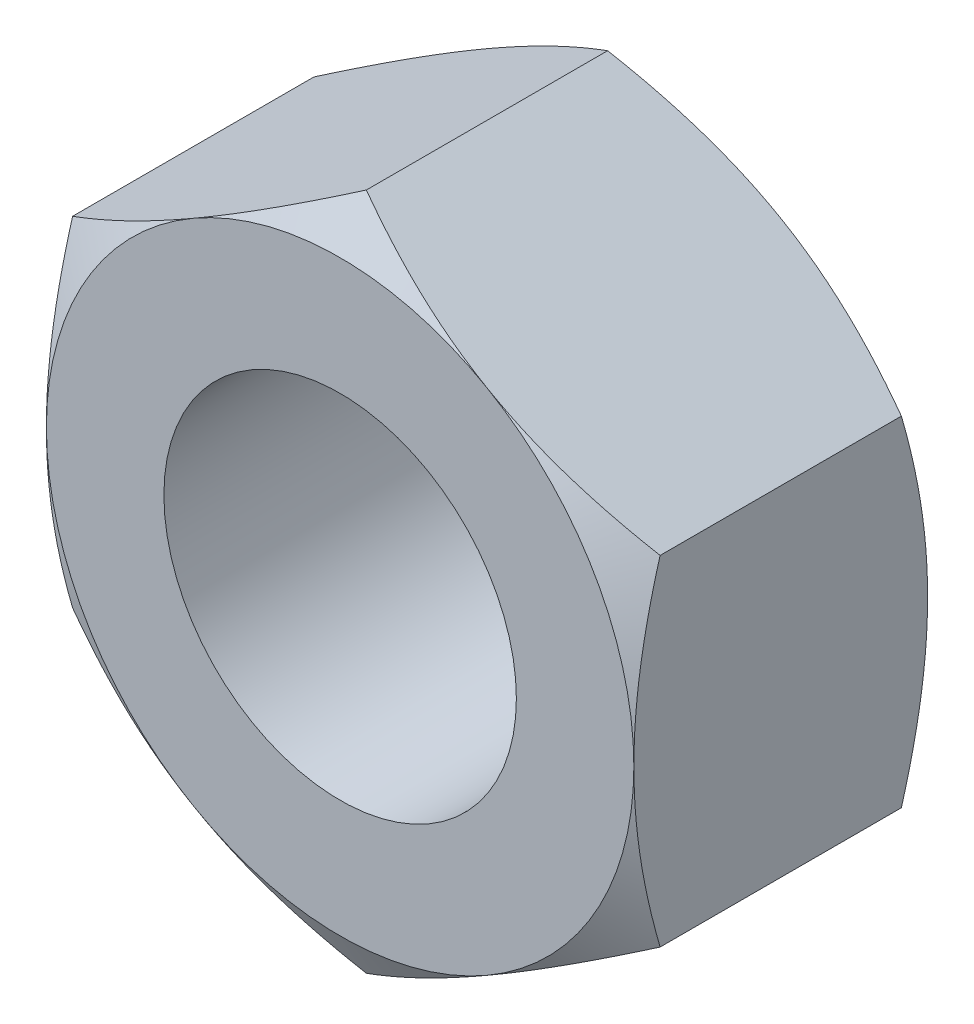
ISO-10303-21;
HEADER;
FILE_DESCRIPTION(('STEP AP214'),'2;1');
FILE_NAME('part.step','',(''),(''),'','','');
FILE_SCHEMA(('AUTOMOTIVE_DESIGN { 1 0 10303 214 1 1 1 1 }'));
ENDSEC;
DATA;
#1=APPLICATION_CONTEXT('core data for automotive mechanical design processes');
#2=APPLICATION_PROTOCOL_DEFINITION('international standard','automotive_design',2000,#1);
#3=PRODUCT_CONTEXT('',#1,'mechanical');
#4=PRODUCT('Part','Part','',(#3));
#5=PRODUCT_RELATED_PRODUCT_CATEGORY('part','',(#4));
#6=PRODUCT_DEFINITION_FORMATION('','',#4);
#7=PRODUCT_DEFINITION_CONTEXT('part definition',#1,'design');
#8=PRODUCT_DEFINITION('design','',#6,#7);
#9=PRODUCT_DEFINITION_SHAPE('','',#8);
#10=(LENGTH_UNIT() NAMED_UNIT(*) SI_UNIT(.MILLI.,.METRE.));
#11=(NAMED_UNIT(*) PLANE_ANGLE_UNIT() SI_UNIT($,.RADIAN.));
#12=(NAMED_UNIT(*) SI_UNIT($,.STERADIAN.) SOLID_ANGLE_UNIT());
#13=UNCERTAINTY_MEASURE_WITH_UNIT(LENGTH_MEASURE(1.E-05),#10,'distance_accuracy_value','');
#14=(GEOMETRIC_REPRESENTATION_CONTEXT(3) GLOBAL_UNCERTAINTY_ASSIGNED_CONTEXT((#13)) GLOBAL_UNIT_ASSIGNED_CONTEXT((#10,
#11,#12)) REPRESENTATION_CONTEXT('',''));
#15=CARTESIAN_POINT('',(0.,0.,0.));
#16=DIRECTION('',(0.,0.,1.));
#17=DIRECTION('',(1.,0.,0.));
#18=AXIS2_PLACEMENT_3D('',#15,#16,#17);
#19=CARTESIAN_POINT('',(-5.,8.66025403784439,0.));
#20=DIRECTION('',(0.,0.,-1.));
#21=DIRECTION('',(-1.,0.,0.));
#22=AXIS2_PLACEMENT_3D('',#19,#20,#21);
#23=PLANE('',#22);
#24=CARTESIAN_POINT('',(0.,0.,0.));
#25=DIRECTION('',(0.,0.,1.));
#26=DIRECTION('',(1.,0.,0.));
#27=AXIS2_PLACEMENT_3D('',#24,#25,#26);
#28=CIRCLE('',#27,3.);
#29=CARTESIAN_POINT('',(3.,0.,0.));
#30=VERTEX_POINT('',#29);
#31=EDGE_CURVE('E318',#30,#30,#28,.T.);
#32=ORIENTED_EDGE('',*,*,#31,.F.);
#33=EDGE_LOOP('',(#32));
#34=FACE_BOUND('',#33,.T.);
#35=CARTESIAN_POINT('',(0.,0.,0.));
#36=DIRECTION('',(0.,0.,-1.));
#37=DIRECTION('',(-1.,0.,0.));
#38=AXIS2_PLACEMENT_3D('',#35,#36,#37);
#39=CIRCLE('',#38,5.);
#40=CARTESIAN_POINT('',(-5.,0.,0.));
#41=VERTEX_POINT('',#40);
#42=CARTESIAN_POINT('',(-2.5,4.3301270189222,0.));
#43=VERTEX_POINT('',#42);
#44=EDGE_CURVE('E326',#41,#43,#39,.T.);
#45=ORIENTED_EDGE('',*,*,#44,.F.);
#46=CARTESIAN_POINT('',(0.,0.,0.));
#47=DIRECTION('',(0.,0.,-1.));
#48=DIRECTION('',(-1.,0.,0.));
#49=AXIS2_PLACEMENT_3D('',#46,#47,#48);
#50=CIRCLE('',#49,5.);
#51=CARTESIAN_POINT('',(-2.5,-4.3301270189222,0.));
#52=VERTEX_POINT('',#51);
#53=EDGE_CURVE('E148',#41,#52,#50,.F.);
#54=ORIENTED_EDGE('',*,*,#53,.T.);
#55=CARTESIAN_POINT('',(2.5,-4.3301270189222,0.));
#56=VERTEX_POINT('',#55);
#57=EDGE_CURVE('E250',#52,#56,#50,.F.);
#58=ORIENTED_EDGE('',*,*,#57,.T.);
#59=CARTESIAN_POINT('',(5.,0.,0.));
#60=VERTEX_POINT('',#59);
#61=EDGE_CURVE('E151',#56,#60,#50,.F.);
#62=ORIENTED_EDGE('',*,*,#61,.T.);
#63=CARTESIAN_POINT('',(2.5,4.3301270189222,0.));
#64=VERTEX_POINT('',#63);
#65=EDGE_CURVE('E126',#60,#64,#50,.F.);
#66=ORIENTED_EDGE('',*,*,#65,.T.);
#67=EDGE_CURVE('E139',#64,#43,#50,.F.);
#68=ORIENTED_EDGE('',*,*,#67,.T.);
#69=EDGE_LOOP('',(#45,#54,#58,#62,#66,#68));
#70=FACE_BOUND('',#69,.T.);
#71=ADVANCED_FACE('F31',(#34,#70),#23,.F.);
#72=CARTESIAN_POINT('',(0.,0.,0.));
#73=DIRECTION('',(0.,0.,-1.));
#74=DIRECTION('',(-1.,0.,0.));
#75=AXIS2_PLACEMENT_3D('',#72,#73,#74);
#76=CONICAL_SURFACE('',#75,5.,1.0471975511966);
#77=CARTESIAN_POINT('',(-5.,-7.76808841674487,-2.44689023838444));
#78=CARTESIAN_POINT('',(-5.,-7.54955729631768,-2.3408271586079));
#79=CARTESIAN_POINT('',(-5.,-7.33052594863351,-2.2357771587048));
#80=CARTESIAN_POINT('',(-5.,-6.89119677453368,-2.02827292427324));
#81=CARTESIAN_POINT('',(-5.,-6.67089875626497,-1.92581909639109));
#82=CARTESIAN_POINT('',(-5.,-6.22764221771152,-1.72356452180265));
#83=CARTESIAN_POINT('',(-5.,-6.00467575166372,-1.62378112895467));
#84=CARTESIAN_POINT('',(-5.,-5.55697391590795,-1.42828024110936));
#85=CARTESIAN_POINT('',(-5.,-5.33223863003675,-1.3325625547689));
#86=CARTESIAN_POINT('',(-5.,-4.87339891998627,-1.14327838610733));
#87=CARTESIAN_POINT('',(-5.,-4.63922509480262,-1.04987922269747));
#88=CARTESIAN_POINT('',(-5.,-4.16814307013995,-0.870116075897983));
#89=CARTESIAN_POINT('',(-5.,-3.93123456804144,-0.783752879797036));
#90=CARTESIAN_POINT('',(-5.,-3.4547449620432,-0.620318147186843));
#91=CARTESIAN_POINT('',(-5.,-3.21517032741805,-0.543227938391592));
#92=CARTESIAN_POINT('',(-5.,-2.73258478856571,-0.400803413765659));
#93=CARTESIAN_POINT('',(-5.,-2.48957498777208,-0.335465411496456));
#94=CARTESIAN_POINT('',(-5.,-2.00129923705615,-0.220011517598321));
#95=CARTESIAN_POINT('',(-5.,-1.75605280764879,-0.169814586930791));
#96=CARTESIAN_POINT('',(-5.,-1.26249605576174,-0.0874824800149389));
#97=CARTESIAN_POINT('',(-5.,-1.0141860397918,-0.0553455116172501));
#98=CARTESIAN_POINT('',(-5.,-0.518993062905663,-0.012117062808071));
#99=CARTESIAN_POINT('',(-5.,-0.272134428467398,-0.000753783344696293));
#100=CARTESIAN_POINT('',(-5.,0.221667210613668,0.000680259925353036));
#101=CARTESIAN_POINT('',(-5.,0.46861021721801,-0.00924951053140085));
#102=CARTESIAN_POINT('',(-5.,0.88737495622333,-0.0434398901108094));
#103=CARTESIAN_POINT('',(-5.,1.05964345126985,-0.0625453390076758));
#104=CARTESIAN_POINT('',(-5.,1.40292147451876,-0.109937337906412));
#105=CARTESIAN_POINT('',(-5.,1.57393083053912,-0.138225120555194));
#106=CARTESIAN_POINT('',(-5.,2.0848367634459,-0.235375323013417));
#107=CARTESIAN_POINT('',(-5.,2.4224263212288,-0.316507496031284));
#108=CARTESIAN_POINT('',(-5.,2.92734712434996,-0.457245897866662));
#109=CARTESIAN_POINT('',(-5.,3.09729243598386,-0.508007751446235));
#110=CARTESIAN_POINT('',(-5.,3.4355315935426,-0.614812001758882));
#111=CARTESIAN_POINT('',(-5.,3.60382542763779,-0.670854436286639));
#112=CARTESIAN_POINT('',(-5.,3.93881633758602,-0.787319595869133));
#113=CARTESIAN_POINT('',(-5.,4.10551390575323,-0.847740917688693));
#114=CARTESIAN_POINT('',(-5.,4.43752572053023,-0.972251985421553));
#115=CARTESIAN_POINT('',(-5.,4.60283999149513,-1.03634166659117));
#116=CARTESIAN_POINT('',(-5.,5.0247181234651,-1.20442083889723));
#117=CARTESIAN_POINT('',(-5.,5.28040451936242,-1.31060995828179));
#118=CARTESIAN_POINT('',(-5.,5.78935527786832,-1.52866046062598));
#119=CARTESIAN_POINT('',(-5.,6.04261943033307,-1.64052233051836));
#120=CARTESIAN_POINT('',(-5.,6.54723296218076,-1.8686538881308));
#121=CARTESIAN_POINT('',(-5.,6.79858179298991,-1.98492478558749));
#122=CARTESIAN_POINT('',(-5.,7.2996679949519,-2.22089526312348));
#123=CARTESIAN_POINT('',(-5.,7.54940532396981,-2.34059493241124));
#124=CARTESIAN_POINT('',(-5.,8.04788706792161,-2.5828728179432));
#125=CARTESIAN_POINT('',(-5.,8.29662972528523,-2.70545464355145));
#126=CARTESIAN_POINT('',(-5.,8.79302192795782,-2.95281408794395));
#127=CARTESIAN_POINT('',(-5.,9.04067146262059,-3.07759172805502));
#128=CARTESIAN_POINT('',(-5.,9.78217969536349,-3.45453689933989));
#129=CARTESIAN_POINT('',(-5.,10.2746876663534,-3.70936064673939));
#130=CARTESIAN_POINT('',(-5.,11.2098406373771,-4.19905291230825));
#131=CARTESIAN_POINT('',(-5.,11.6527184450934,-4.43347890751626));
#132=CARTESIAN_POINT('',(-5.,12.5369382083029,-4.90525945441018));
#133=CARTESIAN_POINT('',(-5.,12.9782800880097,-5.14261414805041));
#134=CARTESIAN_POINT('',(-5.,13.8584885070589,-5.61881737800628));
#135=CARTESIAN_POINT('',(-5.,14.2973585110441,-5.85765952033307));
#136=CARTESIAN_POINT('',(-5.,15.1741337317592,-6.33703983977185));
#137=CARTESIAN_POINT('',(-5.,15.6120390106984,-6.57757790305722));
#138=CARTESIAN_POINT('',(-5.,16.0495987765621,-6.81873886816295));
#139=B_SPLINE_CURVE_WITH_KNOTS('',3,(#77,#78,#79,#80,#81,#82,#83,#84,#85,#86,#87,#88,#89,#90,
#91,#92,#93,#94,#95,#96,#97,#98,#99,#100,#101,#102,#103,#104,#105,#106,#107,#108,#109,#110,#111,
#112,#113,#114,#115,#116,#117,#118,#119,#120,#121,#122,#123,#124,#125,#126,#127,#128,#129,#130,
#131,#132,#133,#134,#135,#136,#137,#138),.UNSPECIFIED.,.F.,.F.,(4,2,2,2,2,2,2,2,2,2,2,2,2,2,2,2,
2,2,2,2,2,2,2,2,2,2,2,2,2,2,4),(0.,0.728738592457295,1.4575906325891,2.19038616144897,
2.92314716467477,3.6793977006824,4.43573274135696,5.19051836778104,5.94506681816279,
6.69550197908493,7.44586265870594,8.18633350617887,8.92682293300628,9.446545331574,
9.96633752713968,11.0064764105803,11.5385246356,12.0705766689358,12.6024589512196,
13.1343318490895,13.9648144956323,14.7953685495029,15.6261521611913,16.4569574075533,
17.2888652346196,18.1207811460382,19.7843134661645,21.2875873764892,22.7909344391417,
24.2898874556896,25.7887408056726),.UNSPECIFIED.);
#140=CARTESIAN_POINT('',(-5.,2.88675134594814,-0.446581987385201));
#141=VERTEX_POINT('',#140);
#142=EDGE_CURVE('E156',#141,#41,#139,.F.);
#143=ORIENTED_EDGE('',*,*,#142,.T.);
#144=ORIENTED_EDGE('',*,*,#44,.T.);
#145=CARTESIAN_POINT('',(0.0002,5.7736181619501,-0.446648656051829));
#146=CARTESIAN_POINT('',(-0.219534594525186,5.64675433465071,-0.373386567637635));
#147=CARTESIAN_POINT('',(-0.441148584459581,5.5188054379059,-0.306751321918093));
#148=CARTESIAN_POINT('',(-0.888213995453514,5.26069210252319,-0.190438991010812));
#149=CARTESIAN_POINT('',(-1.11367335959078,5.13052307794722,-0.140803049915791));
#150=CARTESIAN_POINT('',(-1.56183230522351,4.87177839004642,-0.063551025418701));
#151=CARTESIAN_POINT('',(-1.78446209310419,4.74324302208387,-0.035420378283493));
#152=CARTESIAN_POINT('',(-2.11918990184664,4.54998783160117,-0.0101949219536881));
#153=CARTESIAN_POINT('',(-2.23084219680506,4.48552534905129,-0.00461345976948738));
#154=CARTESIAN_POINT('',(-2.4542499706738,4.35654081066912,0.000797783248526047));
#155=CARTESIAN_POINT('',(-2.56600544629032,4.29201875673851,0.000627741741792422));
#156=CARTESIAN_POINT('',(-2.87218423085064,4.11524635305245,-0.00775363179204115));
#157=CARTESIAN_POINT('',(-3.06650608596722,4.00305457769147,-0.0218297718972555));
#158=CARTESIAN_POINT('',(-3.45386010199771,3.77941563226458,-0.0664652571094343));
#159=CARTESIAN_POINT('',(-3.64689090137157,3.66796924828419,-0.0970398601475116));
#160=CARTESIAN_POINT('',(-4.03502534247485,3.44387972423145,-0.173468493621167));
#161=CARTESIAN_POINT('',(-4.23007999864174,3.33126486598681,-0.219646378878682));
#162=CARTESIAN_POINT('',(-4.61728034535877,3.10771464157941,-0.324451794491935));
#163=CARTESIAN_POINT('',(-4.80943099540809,2.99677641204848,-0.383054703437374));
#164=CARTESIAN_POINT('',(-5.0002,2.8866358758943,-0.446648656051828));
#165=B_SPLINE_CURVE_WITH_KNOTS('',3,(#145,#146,#147,#148,#149,#150,#151,#152,#153,#154,#155,
#156,#157,#158,#159,#160,#161,#162,#163,#164),.UNSPECIFIED.,.F.,.F.,(4,2,2,2,2,2,2,2,2,4),(0.,
0.79255584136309,1.58701660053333,2.36181537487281,2.74884076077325,3.13585419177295,
3.80962362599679,4.48401723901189,5.17336882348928,5.86136694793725),.UNSPECIFIED.);
#166=EDGE_CURVE('E188',#43,#141,#165,.T.);
#167=ORIENTED_EDGE('',*,*,#166,.T.);
#168=EDGE_LOOP('',(#143,#144,#167));
#169=FACE_BOUND('',#168,.T.);
#170=ADVANCED_FACE('F175',(#169),#76,.T.);
#171=CARTESIAN_POINT('',(5.0002,2.8866358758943,-0.446648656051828));
#172=CARTESIAN_POINT('',(4.78046540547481,3.01349970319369,-0.373386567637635));
#173=CARTESIAN_POINT('',(4.55885141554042,3.1414485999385,-0.306751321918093));
#174=CARTESIAN_POINT('',(4.11178600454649,3.39956193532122,-0.190438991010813));
#175=CARTESIAN_POINT('',(3.88632664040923,3.52973095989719,-0.140803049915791));
#176=CARTESIAN_POINT('',(3.43816769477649,3.78847564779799,-0.0635510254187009));
#177=CARTESIAN_POINT('',(3.21553790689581,3.91701101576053,-0.0354203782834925));
#178=CARTESIAN_POINT('',(2.88081009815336,4.11026620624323,-0.0101949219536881));
#179=CARTESIAN_POINT('',(2.76915780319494,4.17472868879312,-0.00461345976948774));
#180=CARTESIAN_POINT('',(2.5457500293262,4.30371322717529,0.000797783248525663));
#181=CARTESIAN_POINT('',(2.43399455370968,4.3682352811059,0.000627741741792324));
#182=CARTESIAN_POINT('',(2.12781576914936,4.54500768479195,-0.00775363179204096));
#183=CARTESIAN_POINT('',(1.93349391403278,4.65719946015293,-0.0218297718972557));
#184=CARTESIAN_POINT('',(1.54613989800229,4.88083840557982,-0.0664652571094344));
#185=CARTESIAN_POINT('',(1.35310909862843,4.99228478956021,-0.0970398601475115));
#186=CARTESIAN_POINT('',(0.964974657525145,5.21637431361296,-0.173468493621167));
#187=CARTESIAN_POINT('',(0.769920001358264,5.32898917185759,-0.219646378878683));
#188=CARTESIAN_POINT('',(0.382719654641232,5.55253939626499,-0.324451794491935));
#189=CARTESIAN_POINT('',(0.190569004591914,5.66347762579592,-0.383054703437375));
#190=CARTESIAN_POINT('',(-0.000199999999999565,5.7736181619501,-0.446648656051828));
#191=B_SPLINE_CURVE_WITH_KNOTS('',3,(#171,#172,#173,#174,#175,#176,#177,#178,#179,#180,#181,
#182,#183,#184,#185,#186,#187,#188,#189,#190),.UNSPECIFIED.,.F.,.F.,(4,2,2,2,2,2,2,2,2,4),(0.,
0.79255584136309,1.58701660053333,2.3618153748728,2.74884076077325,3.13585419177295,
3.80962362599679,4.48401723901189,5.17336882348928,5.86136694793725),.UNSPECIFIED.);
#192=CARTESIAN_POINT('',(0.,5.77350269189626,-0.446581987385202));
#193=VERTEX_POINT('',#192);
#194=EDGE_CURVE('E135',#64,#193,#191,.T.);
#195=ORIENTED_EDGE('',*,*,#194,.T.);
#196=EDGE_CURVE('E142',#193,#43,#165,.T.);
#197=ORIENTED_EDGE('',*,*,#196,.T.);
#198=ORIENTED_EDGE('',*,*,#67,.F.);
#199=EDGE_LOOP('',(#195,#197,#198));
#200=FACE_BOUND('',#199,.T.);
#201=ADVANCED_FACE('F140',(#200),#76,.T.);
#202=CARTESIAN_POINT('',(5.,-7.76808841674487,-2.44689023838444));
#203=CARTESIAN_POINT('',(5.,-7.54955729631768,-2.3408271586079));
#204=CARTESIAN_POINT('',(5.,-7.33052594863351,-2.2357771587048));
#205=CARTESIAN_POINT('',(5.,-6.89119677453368,-2.02827292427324));
#206=CARTESIAN_POINT('',(5.,-6.67089875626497,-1.92581909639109));
#207=CARTESIAN_POINT('',(5.,-6.22764221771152,-1.72356452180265));
#208=CARTESIAN_POINT('',(5.,-6.00467575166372,-1.62378112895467));
#209=CARTESIAN_POINT('',(5.,-5.55697391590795,-1.42828024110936));
#210=CARTESIAN_POINT('',(5.,-5.33223863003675,-1.3325625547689));
#211=CARTESIAN_POINT('',(5.,-4.87339891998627,-1.14327838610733));
#212=CARTESIAN_POINT('',(5.,-4.63922509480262,-1.04987922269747));
#213=CARTESIAN_POINT('',(5.,-4.16814307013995,-0.870116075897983));
#214=CARTESIAN_POINT('',(5.,-3.93123456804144,-0.783752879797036));
#215=CARTESIAN_POINT('',(5.,-3.4547449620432,-0.620318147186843));
#216=CARTESIAN_POINT('',(5.,-3.21517032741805,-0.543227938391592));
#217=CARTESIAN_POINT('',(5.,-2.73258478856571,-0.400803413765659));
#218=CARTESIAN_POINT('',(5.,-2.48957498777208,-0.335465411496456));
#219=CARTESIAN_POINT('',(5.,-2.00129923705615,-0.220011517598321));
#220=CARTESIAN_POINT('',(5.,-1.75605280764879,-0.169814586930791));
#221=CARTESIAN_POINT('',(5.,-1.26249605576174,-0.0874824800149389));
#222=CARTESIAN_POINT('',(5.,-1.0141860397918,-0.0553455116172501));
#223=CARTESIAN_POINT('',(5.,-0.518993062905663,-0.012117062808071));
#224=CARTESIAN_POINT('',(5.,-0.272134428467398,-0.000753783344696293));
#225=CARTESIAN_POINT('',(5.,0.221667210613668,0.000680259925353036));
#226=CARTESIAN_POINT('',(5.,0.46861021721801,-0.00924951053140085));
#227=CARTESIAN_POINT('',(5.,0.88737495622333,-0.0434398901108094));
#228=CARTESIAN_POINT('',(5.,1.05964345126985,-0.0625453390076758));
#229=CARTESIAN_POINT('',(5.,1.40292147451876,-0.109937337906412));
#230=CARTESIAN_POINT('',(5.,1.57393083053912,-0.138225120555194));
#231=CARTESIAN_POINT('',(5.,2.0848367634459,-0.235375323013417));
#232=CARTESIAN_POINT('',(5.,2.4224263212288,-0.316507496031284));
#233=CARTESIAN_POINT('',(5.,2.92734712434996,-0.457245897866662));
#234=CARTESIAN_POINT('',(5.,3.09729243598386,-0.508007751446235));
#235=CARTESIAN_POINT('',(5.,3.4355315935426,-0.614812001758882));
#236=CARTESIAN_POINT('',(5.,3.60382542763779,-0.670854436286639));
#237=CARTESIAN_POINT('',(5.,3.93881633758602,-0.787319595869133));
#238=CARTESIAN_POINT('',(5.,4.10551390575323,-0.847740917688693));
#239=CARTESIAN_POINT('',(5.,4.43752572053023,-0.972251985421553));
#240=CARTESIAN_POINT('',(5.,4.60283999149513,-1.03634166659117));
#241=CARTESIAN_POINT('',(5.,5.0247181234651,-1.20442083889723));
#242=CARTESIAN_POINT('',(5.,5.28040451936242,-1.31060995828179));
#243=CARTESIAN_POINT('',(5.,5.78935527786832,-1.52866046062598));
#244=CARTESIAN_POINT('',(5.,6.04261943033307,-1.64052233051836));
#245=CARTESIAN_POINT('',(5.,6.54723296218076,-1.8686538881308));
#246=CARTESIAN_POINT('',(5.,6.79858179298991,-1.98492478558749));
#247=CARTESIAN_POINT('',(5.,7.2996679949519,-2.22089526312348));
#248=CARTESIAN_POINT('',(5.,7.54940532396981,-2.34059493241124));
#249=CARTESIAN_POINT('',(5.,8.04788706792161,-2.5828728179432));
#250=CARTESIAN_POINT('',(5.,8.29662972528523,-2.70545464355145));
#251=CARTESIAN_POINT('',(5.,8.79302192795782,-2.95281408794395));
#252=CARTESIAN_POINT('',(5.,9.04067146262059,-3.07759172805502));
#253=CARTESIAN_POINT('',(5.,9.78217969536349,-3.45453689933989));
#254=CARTESIAN_POINT('',(5.,10.2746876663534,-3.70936064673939));
#255=CARTESIAN_POINT('',(5.,11.2098406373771,-4.19905291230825));
#256=CARTESIAN_POINT('',(5.,11.6527184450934,-4.43347890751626));
#257=CARTESIAN_POINT('',(5.,12.5369382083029,-4.90525945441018));
#258=CARTESIAN_POINT('',(5.,12.9782800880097,-5.14261414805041));
#259=CARTESIAN_POINT('',(5.,13.8584885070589,-5.61881737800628));
#260=CARTESIAN_POINT('',(5.,14.2973585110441,-5.85765952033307));
#261=CARTESIAN_POINT('',(5.,15.1741337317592,-6.33703983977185));
#262=CARTESIAN_POINT('',(5.,15.6120390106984,-6.57757790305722));
#263=CARTESIAN_POINT('',(5.,16.0495987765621,-6.81873886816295));
#264=B_SPLINE_CURVE_WITH_KNOTS('',3,(#202,#203,#204,#205,#206,#207,#208,#209,#210,#211,#212,
#213,#214,#215,#216,#217,#218,#219,#220,#221,#222,#223,#224,#225,#226,#227,#228,#229,#230,#231,
#232,#233,#234,#235,#236,#237,#238,#239,#240,#241,#242,#243,#244,#245,#246,#247,#248,#249,#250,
#251,#252,#253,#254,#255,#256,#257,#258,#259,#260,#261,#262,#263),.UNSPECIFIED.,.F.,.F.,(4,2,2,
2,2,2,2,2,2,2,2,2,2,2,2,2,2,2,2,2,2,2,2,2,2,2,2,2,2,2,4),(0.,0.728738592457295,1.4575906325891,
2.19038616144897,2.92314716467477,3.6793977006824,4.43573274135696,5.19051836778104,
5.94506681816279,6.69550197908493,7.44586265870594,8.18633350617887,8.92682293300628,
9.446545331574,9.96633752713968,11.0064764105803,11.5385246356,12.0705766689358,
12.6024589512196,13.1343318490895,13.9648144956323,14.7953685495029,15.6261521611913,
16.4569574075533,17.2888652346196,18.1207811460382,19.7843134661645,21.2875873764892,
22.7909344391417,24.2898874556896,25.7887408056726),.UNSPECIFIED.);
#265=CARTESIAN_POINT('',(5.,2.88675134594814,-0.446581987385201));
#266=VERTEX_POINT('',#265);
#267=EDGE_CURVE('E129',#60,#266,#264,.T.);
#268=ORIENTED_EDGE('',*,*,#267,.T.);
#269=EDGE_CURVE('E122',#266,#64,#191,.T.);
#270=ORIENTED_EDGE('',*,*,#269,.T.);
#271=ORIENTED_EDGE('',*,*,#65,.F.);
#272=EDGE_LOOP('',(#268,#270,#271));
#273=FACE_BOUND('',#272,.T.);
#274=ADVANCED_FACE('F124',(#273),#76,.T.);
#275=CARTESIAN_POINT('',(-0.0002,-5.7736181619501,-0.446648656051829));
#276=CARTESIAN_POINT('',(0.219534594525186,-5.64675433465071,-0.373386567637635));
#277=CARTESIAN_POINT('',(0.441148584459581,-5.5188054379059,-0.306751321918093));
#278=CARTESIAN_POINT('',(0.888213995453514,-5.26069210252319,-0.190438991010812));
#279=CARTESIAN_POINT('',(1.11367335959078,-5.13052307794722,-0.140803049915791));
#280=CARTESIAN_POINT('',(1.56183230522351,-4.87177839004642,-0.063551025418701));
#281=CARTESIAN_POINT('',(1.78446209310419,-4.74324302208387,-0.035420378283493));
#282=CARTESIAN_POINT('',(2.11918990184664,-4.54998783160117,-0.0101949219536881));
#283=CARTESIAN_POINT('',(2.23084219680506,-4.48552534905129,-0.00461345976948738));
#284=CARTESIAN_POINT('',(2.4542499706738,-4.35654081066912,0.000797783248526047));
#285=CARTESIAN_POINT('',(2.56600544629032,-4.29201875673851,0.000627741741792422));
#286=CARTESIAN_POINT('',(2.87218423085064,-4.11524635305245,-0.00775363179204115));
#287=CARTESIAN_POINT('',(3.06650608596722,-4.00305457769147,-0.0218297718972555));
#288=CARTESIAN_POINT('',(3.45386010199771,-3.77941563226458,-0.0664652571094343));
#289=CARTESIAN_POINT('',(3.64689090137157,-3.66796924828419,-0.0970398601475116));
#290=CARTESIAN_POINT('',(4.03502534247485,-3.44387972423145,-0.173468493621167));
#291=CARTESIAN_POINT('',(4.23007999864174,-3.33126486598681,-0.219646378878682));
#292=CARTESIAN_POINT('',(4.61728034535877,-3.10771464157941,-0.324451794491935));
#293=CARTESIAN_POINT('',(4.80943099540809,-2.99677641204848,-0.383054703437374));
#294=CARTESIAN_POINT('',(5.0002,-2.8866358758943,-0.446648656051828));
#295=B_SPLINE_CURVE_WITH_KNOTS('',3,(#275,#276,#277,#278,#279,#280,#281,#282,#283,#284,#285,
#286,#287,#288,#289,#290,#291,#292,#293,#294),.UNSPECIFIED.,.F.,.F.,(4,2,2,2,2,2,2,2,2,4),(0.,
0.79255584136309,1.58701660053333,2.36181537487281,2.74884076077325,3.13585419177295,
3.80962362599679,4.48401723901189,5.17336882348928,5.86136694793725),.UNSPECIFIED.);
#296=CARTESIAN_POINT('',(5.,-2.88675134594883,-0.446581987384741));
#297=VERTEX_POINT('',#296);
#298=EDGE_CURVE('E202',#56,#297,#295,.T.);
#299=ORIENTED_EDGE('',*,*,#298,.T.);
#300=EDGE_CURVE('E201',#297,#60,#264,.T.);
#301=ORIENTED_EDGE('',*,*,#300,.T.);
#302=ORIENTED_EDGE('',*,*,#61,.F.);
#303=EDGE_LOOP('',(#299,#301,#302));
#304=FACE_BOUND('',#303,.T.);
#305=ADVANCED_FACE('F426',(#304),#76,.T.);
#306=CARTESIAN_POINT('',(0.,-5.77350269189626,-0.446581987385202));
#307=VERTEX_POINT('',#306);
#308=EDGE_CURVE('E260',#307,#56,#295,.T.);
#309=ORIENTED_EDGE('',*,*,#308,.T.);
#310=ORIENTED_EDGE('',*,*,#57,.F.);
#311=CARTESIAN_POINT('',(-5.0002,-2.8866358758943,-0.446648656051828));
#312=CARTESIAN_POINT('',(-4.78046540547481,-3.01349970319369,-0.373386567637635));
#313=CARTESIAN_POINT('',(-4.55885141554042,-3.1414485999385,-0.306751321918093));
#314=CARTESIAN_POINT('',(-4.11178600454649,-3.39956193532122,-0.190438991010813));
#315=CARTESIAN_POINT('',(-3.88632664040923,-3.52973095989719,-0.140803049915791));
#316=CARTESIAN_POINT('',(-3.43816769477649,-3.78847564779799,-0.0635510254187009));
#317=CARTESIAN_POINT('',(-3.21553790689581,-3.91701101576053,-0.0354203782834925));
#318=CARTESIAN_POINT('',(-2.88081009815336,-4.11026620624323,-0.0101949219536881));
#319=CARTESIAN_POINT('',(-2.76915780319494,-4.17472868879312,-0.00461345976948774));
#320=CARTESIAN_POINT('',(-2.5457500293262,-4.30371322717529,0.000797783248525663));
#321=CARTESIAN_POINT('',(-2.43399455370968,-4.3682352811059,0.000627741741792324));
#322=CARTESIAN_POINT('',(-2.12781576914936,-4.54500768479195,-0.00775363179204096));
#323=CARTESIAN_POINT('',(-1.93349391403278,-4.65719946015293,-0.0218297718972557));
#324=CARTESIAN_POINT('',(-1.54613989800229,-4.88083840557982,-0.0664652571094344));
#325=CARTESIAN_POINT('',(-1.35310909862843,-4.99228478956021,-0.0970398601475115));
#326=CARTESIAN_POINT('',(-0.964974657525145,-5.21637431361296,-0.173468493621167));
#327=CARTESIAN_POINT('',(-0.769920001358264,-5.32898917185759,-0.219646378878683));
#328=CARTESIAN_POINT('',(-0.382719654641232,-5.55253939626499,-0.324451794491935));
#329=CARTESIAN_POINT('',(-0.190569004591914,-5.66347762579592,-0.383054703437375));
#330=CARTESIAN_POINT('',(0.000199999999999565,-5.7736181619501,-0.446648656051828));
#331=B_SPLINE_CURVE_WITH_KNOTS('',3,(#311,#312,#313,#314,#315,#316,#317,#318,#319,#320,#321,
#322,#323,#324,#325,#326,#327,#328,#329,#330),.UNSPECIFIED.,.F.,.F.,(4,2,2,2,2,2,2,2,2,4),(0.,
0.79255584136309,1.58701660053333,2.3618153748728,2.74884076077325,3.13585419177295,
3.80962362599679,4.48401723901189,5.17336882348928,5.86136694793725),.UNSPECIFIED.);
#332=EDGE_CURVE('E264',#52,#307,#331,.T.);
#333=ORIENTED_EDGE('',*,*,#332,.T.);
#334=EDGE_LOOP('',(#309,#310,#333));
#335=FACE_BOUND('',#334,.T.);
#336=ADVANCED_FACE('F181',(#335),#76,.T.);
#337=CARTESIAN_POINT('',(-5.,-2.88675134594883,-0.446581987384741));
#338=VERTEX_POINT('',#337);
#339=EDGE_CURVE('E169',#338,#52,#331,.T.);
#340=ORIENTED_EDGE('',*,*,#339,.T.);
#341=ORIENTED_EDGE('',*,*,#53,.F.);
#342=EDGE_CURVE('E134',#41,#338,#139,.F.);
#343=ORIENTED_EDGE('',*,*,#342,.T.);
#344=EDGE_LOOP('',(#340,#341,#343));
#345=FACE_BOUND('',#344,.T.);
#346=ADVANCED_FACE('F269',(#345),#76,.T.);
#347=CARTESIAN_POINT('',(5.,2.88675134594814,-5.));
#348=DIRECTION('',(0.5,0.866025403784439,0.));
#349=DIRECTION('',(-0.866025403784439,0.5,0.));
#350=AXIS2_PLACEMENT_3D('',#347,#348,#349);
#351=PLANE('',#350);
#352=CARTESIAN_POINT('',(-0.0002,5.7736181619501,-4.55335134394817));
#353=CARTESIAN_POINT('',(0.219534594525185,5.64675433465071,-4.62661343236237));
#354=CARTESIAN_POINT('',(0.441148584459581,5.5188054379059,-4.69324867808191));
#355=CARTESIAN_POINT('',(0.888213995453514,5.26069210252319,-4.80956100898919));
#356=CARTESIAN_POINT('',(1.11367335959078,5.13052307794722,-4.85919695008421));
#357=CARTESIAN_POINT('',(1.56183230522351,4.87177839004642,-4.9364489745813));
#358=CARTESIAN_POINT('',(1.78446209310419,4.74324302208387,-4.96457962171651));
#359=CARTESIAN_POINT('',(2.11918990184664,4.54998783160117,-4.98980507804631));
#360=CARTESIAN_POINT('',(2.23084219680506,4.48552534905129,-4.99538654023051));
#361=CARTESIAN_POINT('',(2.4542499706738,4.35654081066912,-5.00079778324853));
#362=CARTESIAN_POINT('',(2.56600544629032,4.29201875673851,-5.00062774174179));
#363=CARTESIAN_POINT('',(2.87218423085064,4.11524635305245,-4.99224636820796));
#364=CARTESIAN_POINT('',(3.06650608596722,4.00305457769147,-4.97817022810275));
#365=CARTESIAN_POINT('',(3.45386010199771,3.77941563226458,-4.93353474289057));
#366=CARTESIAN_POINT('',(3.64689090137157,3.66796924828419,-4.90296013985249));
#367=CARTESIAN_POINT('',(4.03502534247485,3.44387972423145,-4.82653150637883));
#368=CARTESIAN_POINT('',(4.23007999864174,3.33126486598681,-4.78035362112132));
#369=CARTESIAN_POINT('',(4.61728034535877,3.10771464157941,-4.67554820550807));
#370=CARTESIAN_POINT('',(4.80943099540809,2.99677641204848,-4.61694529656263));
#371=CARTESIAN_POINT('',(5.0002,2.8866358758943,-4.55335134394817));
#372=B_SPLINE_CURVE_WITH_KNOTS('',3,(#352,#353,#354,#355,#356,#357,#358,#359,#360,#361,#362,
#363,#364,#365,#366,#367,#368,#369,#370,#371),.UNSPECIFIED.,.F.,.F.,(4,2,2,2,2,2,2,2,2,4),(0.,
0.79255584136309,1.58701660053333,2.36181537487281,2.74884076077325,3.13585419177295,
3.80962362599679,4.48401723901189,5.17336882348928,5.86136694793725),.UNSPECIFIED.);
#373=CARTESIAN_POINT('',(0.,5.77350269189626,-4.5534180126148));
#374=VERTEX_POINT('',#373);
#375=CARTESIAN_POINT('',(2.5,4.3301270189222,-5.));
#376=VERTEX_POINT('',#375);
#377=EDGE_CURVE('E235',#374,#376,#372,.T.);
#378=ORIENTED_EDGE('',*,*,#377,.F.);
#379=DIRECTION('',(0.,0.,1.));
#380=VECTOR('',#379,1.);
#381=CARTESIAN_POINT('',(0.,5.77350269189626,-5.));
#382=LINE('',#381,#380);
#383=EDGE_CURVE('E155',#374,#193,#382,.T.);
#384=ORIENTED_EDGE('',*,*,#383,.T.);
#385=ORIENTED_EDGE('',*,*,#194,.F.);
#386=ORIENTED_EDGE('',*,*,#269,.F.);
#387=DIRECTION('',(0.,0.,1.));
#388=VECTOR('',#387,1.);
#389=CARTESIAN_POINT('',(5.,2.88675134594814,-5.));
#390=LINE('',#389,#388);
#391=CARTESIAN_POINT('',(5.,2.88675134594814,-4.5534180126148));
#392=VERTEX_POINT('',#391);
#393=EDGE_CURVE('E147',#392,#266,#390,.T.);
#394=ORIENTED_EDGE('',*,*,#393,.F.);
#395=EDGE_CURVE('E230',#376,#392,#372,.T.);
#396=ORIENTED_EDGE('',*,*,#395,.F.);
#397=EDGE_LOOP('',(#378,#384,#385,#386,#394,#396));
#398=FACE_BOUND('',#397,.T.);
#399=ADVANCED_FACE('F33',(#398),#351,.T.);
#400=CARTESIAN_POINT('',(5.,-2.88675134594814,-5.));
#401=DIRECTION('',(1.,0.,0.));
#402=DIRECTION('',(0.,0.,-1.));
#403=AXIS2_PLACEMENT_3D('',#400,#401,#402);
#404=PLANE('',#403);
#405=CARTESIAN_POINT('',(5.,-7.76808841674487,-2.55310976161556));
#406=CARTESIAN_POINT('',(5.,-7.54955729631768,-2.6591728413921));
#407=CARTESIAN_POINT('',(5.,-7.33052594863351,-2.7642228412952));
#408=CARTESIAN_POINT('',(5.,-6.89119677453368,-2.97172707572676));
#409=CARTESIAN_POINT('',(5.,-6.67089875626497,-3.07418090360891));
#410=CARTESIAN_POINT('',(5.,-6.22764221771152,-3.27643547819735));
#411=CARTESIAN_POINT('',(5.,-6.00467575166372,-3.37621887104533));
#412=CARTESIAN_POINT('',(5.,-5.55697391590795,-3.57171975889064));
#413=CARTESIAN_POINT('',(5.,-5.33223863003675,-3.6674374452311));
#414=CARTESIAN_POINT('',(5.,-4.87339891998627,-3.85672161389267));
#415=CARTESIAN_POINT('',(5.,-4.63922509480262,-3.95012077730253));
#416=CARTESIAN_POINT('',(5.,-4.16814307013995,-4.12988392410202));
#417=CARTESIAN_POINT('',(5.,-3.93123456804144,-4.21624712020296));
#418=CARTESIAN_POINT('',(5.,-3.4547449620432,-4.37968185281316));
#419=CARTESIAN_POINT('',(5.,-3.21517032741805,-4.45677206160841));
#420=CARTESIAN_POINT('',(5.,-2.73258478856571,-4.59919658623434));
#421=CARTESIAN_POINT('',(5.,-2.48957498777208,-4.66453458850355));
#422=CARTESIAN_POINT('',(5.,-2.00129923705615,-4.77998848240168));
#423=CARTESIAN_POINT('',(5.,-1.75605280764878,-4.83018541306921));
#424=CARTESIAN_POINT('',(5.,-1.26249605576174,-4.91251751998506));
#425=CARTESIAN_POINT('',(5.,-1.0141860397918,-4.94465448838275));
#426=CARTESIAN_POINT('',(5.,-0.518993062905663,-4.98788293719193));
#427=CARTESIAN_POINT('',(5.,-0.272134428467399,-4.9992462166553));
#428=CARTESIAN_POINT('',(5.,0.221667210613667,-5.00068025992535));
#429=CARTESIAN_POINT('',(5.,0.468610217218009,-4.9907504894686));
#430=CARTESIAN_POINT('',(5.,0.88737495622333,-4.95656010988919));
#431=CARTESIAN_POINT('',(5.,1.05964345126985,-4.93745466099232));
#432=CARTESIAN_POINT('',(5.,1.40292147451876,-4.89006266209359));
#433=CARTESIAN_POINT('',(5.,1.57393083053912,-4.86177487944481));
#434=CARTESIAN_POINT('',(5.,2.0848367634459,-4.76462467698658));
#435=CARTESIAN_POINT('',(5.,2.4224263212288,-4.68349250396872));
#436=CARTESIAN_POINT('',(5.,2.92734712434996,-4.54275410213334));
#437=CARTESIAN_POINT('',(5.,3.09729243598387,-4.49199224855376));
#438=CARTESIAN_POINT('',(5.,3.4355315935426,-4.38518799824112));
#439=CARTESIAN_POINT('',(5.,3.60382542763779,-4.32914556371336));
#440=CARTESIAN_POINT('',(5.,3.93881633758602,-4.21268040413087));
#441=CARTESIAN_POINT('',(5.,4.10551390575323,-4.15225908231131));
#442=CARTESIAN_POINT('',(5.,4.43752572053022,-4.02774801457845));
#443=CARTESIAN_POINT('',(5.,4.60283999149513,-3.96365833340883));
#444=CARTESIAN_POINT('',(5.,5.02471812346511,-3.79557916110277));
#445=CARTESIAN_POINT('',(5.,5.28040451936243,-3.68939004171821));
#446=CARTESIAN_POINT('',(5.,5.78935527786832,-3.47133953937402));
#447=CARTESIAN_POINT('',(5.,6.04261943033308,-3.35947766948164));
#448=CARTESIAN_POINT('',(5.,6.54723296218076,-3.1313461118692));
#449=CARTESIAN_POINT('',(5.,6.79858179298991,-3.01507521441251));
#450=CARTESIAN_POINT('',(5.,7.2996679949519,-2.77910473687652));
#451=CARTESIAN_POINT('',(5.,7.54940532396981,-2.65940506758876));
#452=CARTESIAN_POINT('',(5.,8.04788706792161,-2.4171271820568));
#453=CARTESIAN_POINT('',(5.,8.29662972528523,-2.29454535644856));
#454=CARTESIAN_POINT('',(5.,8.79302192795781,-2.04718591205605));
#455=CARTESIAN_POINT('',(5.,9.04067146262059,-1.92240827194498));
#456=CARTESIAN_POINT('',(5.,9.78217969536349,-1.54546310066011));
#457=CARTESIAN_POINT('',(5.,10.2746876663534,-1.29063935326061));
#458=CARTESIAN_POINT('',(5.,11.2098406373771,-0.800947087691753));
#459=CARTESIAN_POINT('',(5.,11.6527184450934,-0.566521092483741));
#460=CARTESIAN_POINT('',(5.,12.5369382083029,-0.0947405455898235));
#461=CARTESIAN_POINT('',(5.,12.9782800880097,0.142614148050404));
#462=CARTESIAN_POINT('',(5.,13.8584885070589,0.618817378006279));
#463=CARTESIAN_POINT('',(5.,14.2973585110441,0.857659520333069));
#464=CARTESIAN_POINT('',(5.,15.1741337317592,1.33703983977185));
#465=CARTESIAN_POINT('',(5.,15.6120390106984,1.57757790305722));
#466=CARTESIAN_POINT('',(5.,16.0495987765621,1.81873886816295));
#467=B_SPLINE_CURVE_WITH_KNOTS('',3,(#405,#406,#407,#408,#409,#410,#411,#412,#413,#414,#415,
#416,#417,#418,#419,#420,#421,#422,#423,#424,#425,#426,#427,#428,#429,#430,#431,#432,#433,#434,
#435,#436,#437,#438,#439,#440,#441,#442,#443,#444,#445,#446,#447,#448,#449,#450,#451,#452,#453,
#454,#455,#456,#457,#458,#459,#460,#461,#462,#463,#464,#465,#466),.UNSPECIFIED.,.F.,.F.,(4,2,2,
2,2,2,2,2,2,2,2,2,2,2,2,2,2,2,2,2,2,2,2,2,2,2,2,2,2,2,4),(0.,0.728738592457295,1.4575906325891,
2.19038616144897,2.92314716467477,3.67939770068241,4.43573274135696,5.19051836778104,
5.94506681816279,6.69550197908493,7.44586265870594,8.18633350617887,8.92682293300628,
9.446545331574,9.96633752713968,11.0064764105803,11.5385246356,12.0705766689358,
12.6024589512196,13.1343318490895,13.9648144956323,14.7953685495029,15.6261521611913,
16.4569574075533,17.2888652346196,18.1207811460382,19.7843134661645,21.2875873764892,
22.7909344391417,24.2898874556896,25.7887408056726),.UNSPECIFIED.);
#468=CARTESIAN_POINT('',(5.,0.,-5.));
#469=VERTEX_POINT('',#468);
#470=EDGE_CURVE('E224',#392,#469,#467,.F.);
#471=ORIENTED_EDGE('',*,*,#470,.F.);
#472=ORIENTED_EDGE('',*,*,#393,.T.);
#473=ORIENTED_EDGE('',*,*,#267,.F.);
#474=ORIENTED_EDGE('',*,*,#300,.F.);
#475=DIRECTION('',(0.,0.,1.));
#476=VECTOR('',#475,1.);
#477=CARTESIAN_POINT('',(5.,-2.88675134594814,-5.));
#478=LINE('',#477,#476);
#479=CARTESIAN_POINT('',(5.,-2.88675134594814,-4.5534180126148));
#480=VERTEX_POINT('',#479);
#481=EDGE_CURVE('E237',#480,#297,#478,.T.);
#482=ORIENTED_EDGE('',*,*,#481,.F.);
#483=EDGE_CURVE('E218',#469,#480,#467,.F.);
#484=ORIENTED_EDGE('',*,*,#483,.F.);
#485=EDGE_LOOP('',(#471,#472,#473,#474,#482,#484));
#486=FACE_BOUND('',#485,.T.);
#487=ADVANCED_FACE('F208',(#486),#404,.T.);
#488=CARTESIAN_POINT('',(5.,-2.88675134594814,-5.));
#489=DIRECTION('',(0.5,-0.866025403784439,0.));
#490=DIRECTION('',(0.866025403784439,0.5,0.));
#491=AXIS2_PLACEMENT_3D('',#488,#489,#490);
#492=PLANE('',#491);
#493=CARTESIAN_POINT('',(5.0002,-2.8866358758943,-4.55335134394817));
#494=CARTESIAN_POINT('',(4.78046540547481,-3.01349970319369,-4.62661343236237));
#495=CARTESIAN_POINT('',(4.55885141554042,-3.1414485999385,-4.69324867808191));
#496=CARTESIAN_POINT('',(4.11178600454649,-3.39956193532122,-4.80956100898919));
#497=CARTESIAN_POINT('',(3.88632664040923,-3.52973095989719,-4.85919695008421));
#498=CARTESIAN_POINT('',(3.43816769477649,-3.78847564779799,-4.9364489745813));
#499=CARTESIAN_POINT('',(3.21553790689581,-3.91701101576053,-4.96457962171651));
#500=CARTESIAN_POINT('',(2.88081009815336,-4.11026620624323,-4.98980507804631));
#501=CARTESIAN_POINT('',(2.76915780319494,-4.17472868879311,-4.99538654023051));
#502=CARTESIAN_POINT('',(2.5457500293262,-4.30371322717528,-5.00079778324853));
#503=CARTESIAN_POINT('',(2.43399455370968,-4.3682352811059,-5.00062774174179));
#504=CARTESIAN_POINT('',(2.12781576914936,-4.54500768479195,-4.99224636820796));
#505=CARTESIAN_POINT('',(1.93349391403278,-4.65719946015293,-4.97817022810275));
#506=CARTESIAN_POINT('',(1.54613989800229,-4.88083840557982,-4.93353474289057));
#507=CARTESIAN_POINT('',(1.35310909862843,-4.99228478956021,-4.90296013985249));
#508=CARTESIAN_POINT('',(0.964974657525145,-5.21637431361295,-4.82653150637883));
#509=CARTESIAN_POINT('',(0.769920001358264,-5.32898917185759,-4.78035362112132));
#510=CARTESIAN_POINT('',(0.382719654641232,-5.55253939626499,-4.67554820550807));
#511=CARTESIAN_POINT('',(0.190569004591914,-5.66347762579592,-4.61694529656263));
#512=CARTESIAN_POINT('',(-0.000199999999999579,-5.7736181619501,-4.55335134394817));
#513=B_SPLINE_CURVE_WITH_KNOTS('',3,(#493,#494,#495,#496,#497,#498,#499,#500,#501,#502,#503,
#504,#505,#506,#507,#508,#509,#510,#511,#512),.UNSPECIFIED.,.F.,.F.,(4,2,2,2,2,2,2,2,2,4),(0.,
0.79255584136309,1.58701660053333,2.3618153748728,2.74884076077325,3.13585419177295,
3.80962362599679,4.48401723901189,5.17336882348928,5.86136694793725),.UNSPECIFIED.);
#514=CARTESIAN_POINT('',(2.5,-4.3301270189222,-5.));
#515=VERTEX_POINT('',#514);
#516=EDGE_CURVE('E55',#480,#515,#513,.T.);
#517=ORIENTED_EDGE('',*,*,#516,.F.);
#518=ORIENTED_EDGE('',*,*,#481,.T.);
#519=ORIENTED_EDGE('',*,*,#298,.F.);
#520=ORIENTED_EDGE('',*,*,#308,.F.);
#521=DIRECTION('',(0.,0.,1.));
#522=VECTOR('',#521,1.);
#523=CARTESIAN_POINT('',(0.,-5.77350269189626,-5.));
#524=LINE('',#523,#522);
#525=CARTESIAN_POINT('',(0.,-5.77350269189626,-4.5534180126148));
#526=VERTEX_POINT('',#525);
#527=EDGE_CURVE('E240',#526,#307,#524,.T.);
#528=ORIENTED_EDGE('',*,*,#527,.F.);
#529=EDGE_CURVE('E225',#515,#526,#513,.T.);
#530=ORIENTED_EDGE('',*,*,#529,.F.);
#531=EDGE_LOOP('',(#517,#518,#519,#520,#528,#530));
#532=FACE_BOUND('',#531,.T.);
#533=ADVANCED_FACE('F212',(#532),#492,.T.);
#534=CARTESIAN_POINT('',(-5.,-2.88675134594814,-5.));
#535=DIRECTION('',(-0.5,-0.866025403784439,0.));
#536=DIRECTION('',(0.866025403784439,-0.5,0.));
#537=AXIS2_PLACEMENT_3D('',#534,#535,#536);
#538=PLANE('',#537);
#539=CARTESIAN_POINT('',(0.0002,-5.7736181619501,-4.55335134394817));
#540=CARTESIAN_POINT('',(-0.219534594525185,-5.64675433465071,-4.62661343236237));
#541=CARTESIAN_POINT('',(-0.441148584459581,-5.5188054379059,-4.69324867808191));
#542=CARTESIAN_POINT('',(-0.888213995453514,-5.26069210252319,-4.80956100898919));
#543=CARTESIAN_POINT('',(-1.11367335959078,-5.13052307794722,-4.85919695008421));
#544=CARTESIAN_POINT('',(-1.56183230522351,-4.87177839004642,-4.9364489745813));
#545=CARTESIAN_POINT('',(-1.78446209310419,-4.74324302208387,-4.96457962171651));
#546=CARTESIAN_POINT('',(-2.11918990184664,-4.54998783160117,-4.98980507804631));
#547=CARTESIAN_POINT('',(-2.23084219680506,-4.48552534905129,-4.99538654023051));
#548=CARTESIAN_POINT('',(-2.4542499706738,-4.35654081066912,-5.00079778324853));
#549=CARTESIAN_POINT('',(-2.56600544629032,-4.29201875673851,-5.00062774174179));
#550=CARTESIAN_POINT('',(-2.87218423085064,-4.11524635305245,-4.99224636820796));
#551=CARTESIAN_POINT('',(-3.06650608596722,-4.00305457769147,-4.97817022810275));
#552=CARTESIAN_POINT('',(-3.45386010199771,-3.77941563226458,-4.93353474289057));
#553=CARTESIAN_POINT('',(-3.64689090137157,-3.66796924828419,-4.90296013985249));
#554=CARTESIAN_POINT('',(-4.03502534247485,-3.44387972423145,-4.82653150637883));
#555=CARTESIAN_POINT('',(-4.23007999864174,-3.33126486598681,-4.78035362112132));
#556=CARTESIAN_POINT('',(-4.61728034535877,-3.10771464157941,-4.67554820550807));
#557=CARTESIAN_POINT('',(-4.80943099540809,-2.99677641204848,-4.61694529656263));
#558=CARTESIAN_POINT('',(-5.0002,-2.8866358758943,-4.55335134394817));
#559=B_SPLINE_CURVE_WITH_KNOTS('',3,(#539,#540,#541,#542,#543,#544,#545,#546,#547,#548,#549,
#550,#551,#552,#553,#554,#555,#556,#557,#558),.UNSPECIFIED.,.F.,.F.,(4,2,2,2,2,2,2,2,2,4),(0.,
0.79255584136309,1.58701660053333,2.36181537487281,2.74884076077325,3.13585419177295,
3.80962362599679,4.48401723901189,5.17336882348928,5.86136694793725),.UNSPECIFIED.);
#560=CARTESIAN_POINT('',(-2.5,-4.3301270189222,-5.));
#561=VERTEX_POINT('',#560);
#562=EDGE_CURVE('E48',#526,#561,#559,.T.);
#563=ORIENTED_EDGE('',*,*,#562,.F.);
#564=ORIENTED_EDGE('',*,*,#527,.T.);
#565=ORIENTED_EDGE('',*,*,#332,.F.);
#566=ORIENTED_EDGE('',*,*,#339,.F.);
#567=DIRECTION('',(0.,0.,1.));
#568=VECTOR('',#567,1.);
#569=CARTESIAN_POINT('',(-5.,-2.88675134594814,-5.));
#570=LINE('',#569,#568);
#571=CARTESIAN_POINT('',(-5.,-2.88675134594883,-4.55341801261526));
#572=VERTEX_POINT('',#571);
#573=EDGE_CURVE('E243',#572,#338,#570,.T.);
#574=ORIENTED_EDGE('',*,*,#573,.F.);
#575=EDGE_CURVE('E284',#561,#572,#559,.T.);
#576=ORIENTED_EDGE('',*,*,#575,.F.);
#577=EDGE_LOOP('',(#563,#564,#565,#566,#574,#576));
#578=FACE_BOUND('',#577,.T.);
#579=ADVANCED_FACE('F274',(#578),#538,.T.);
#580=CARTESIAN_POINT('',(-5.,-2.88675134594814,-5.));
#581=DIRECTION('',(-1.,0.,0.));
#582=DIRECTION('',(0.,0.,1.));
#583=AXIS2_PLACEMENT_3D('',#580,#581,#582);
#584=PLANE('',#583);
#585=CARTESIAN_POINT('',(-5.,-7.76808841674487,-2.55310976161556));
#586=CARTESIAN_POINT('',(-5.,-7.54955729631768,-2.6591728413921));
#587=CARTESIAN_POINT('',(-5.,-7.33052594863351,-2.7642228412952));
#588=CARTESIAN_POINT('',(-5.,-6.89119677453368,-2.97172707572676));
#589=CARTESIAN_POINT('',(-5.,-6.67089875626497,-3.07418090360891));
#590=CARTESIAN_POINT('',(-5.,-6.22764221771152,-3.27643547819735));
#591=CARTESIAN_POINT('',(-5.,-6.00467575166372,-3.37621887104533));
#592=CARTESIAN_POINT('',(-5.,-5.55697391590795,-3.57171975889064));
#593=CARTESIAN_POINT('',(-5.,-5.33223863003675,-3.6674374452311));
#594=CARTESIAN_POINT('',(-5.,-4.87339891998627,-3.85672161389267));
#595=CARTESIAN_POINT('',(-5.,-4.63922509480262,-3.95012077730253));
#596=CARTESIAN_POINT('',(-5.,-4.16814307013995,-4.12988392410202));
#597=CARTESIAN_POINT('',(-5.,-3.93123456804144,-4.21624712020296));
#598=CARTESIAN_POINT('',(-5.,-3.4547449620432,-4.37968185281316));
#599=CARTESIAN_POINT('',(-5.,-3.21517032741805,-4.45677206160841));
#600=CARTESIAN_POINT('',(-5.,-2.73258478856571,-4.59919658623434));
#601=CARTESIAN_POINT('',(-5.,-2.48957498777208,-4.66453458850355));
#602=CARTESIAN_POINT('',(-5.,-2.00129923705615,-4.77998848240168));
#603=CARTESIAN_POINT('',(-5.,-1.75605280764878,-4.83018541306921));
#604=CARTESIAN_POINT('',(-5.,-1.26249605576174,-4.91251751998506));
#605=CARTESIAN_POINT('',(-5.,-1.0141860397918,-4.94465448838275));
#606=CARTESIAN_POINT('',(-5.,-0.518993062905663,-4.98788293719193));
#607=CARTESIAN_POINT('',(-5.,-0.272134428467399,-4.9992462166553));
#608=CARTESIAN_POINT('',(-5.,0.221667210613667,-5.00068025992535));
#609=CARTESIAN_POINT('',(-5.,0.468610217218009,-4.9907504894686));
#610=CARTESIAN_POINT('',(-5.,0.88737495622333,-4.95656010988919));
#611=CARTESIAN_POINT('',(-5.,1.05964345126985,-4.93745466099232));
#612=CARTESIAN_POINT('',(-5.,1.40292147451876,-4.89006266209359));
#613=CARTESIAN_POINT('',(-5.,1.57393083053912,-4.86177487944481));
#614=CARTESIAN_POINT('',(-5.,2.0848367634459,-4.76462467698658));
#615=CARTESIAN_POINT('',(-5.,2.4224263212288,-4.68349250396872));
#616=CARTESIAN_POINT('',(-5.,2.92734712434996,-4.54275410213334));
#617=CARTESIAN_POINT('',(-5.,3.09729243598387,-4.49199224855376));
#618=CARTESIAN_POINT('',(-5.,3.4355315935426,-4.38518799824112));
#619=CARTESIAN_POINT('',(-5.,3.60382542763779,-4.32914556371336));
#620=CARTESIAN_POINT('',(-5.,3.93881633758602,-4.21268040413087));
#621=CARTESIAN_POINT('',(-5.,4.10551390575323,-4.15225908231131));
#622=CARTESIAN_POINT('',(-5.,4.43752572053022,-4.02774801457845));
#623=CARTESIAN_POINT('',(-5.,4.60283999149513,-3.96365833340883));
#624=CARTESIAN_POINT('',(-5.,5.02471812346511,-3.79557916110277));
#625=CARTESIAN_POINT('',(-5.,5.28040451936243,-3.68939004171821));
#626=CARTESIAN_POINT('',(-5.,5.78935527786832,-3.47133953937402));
#627=CARTESIAN_POINT('',(-5.,6.04261943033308,-3.35947766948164));
#628=CARTESIAN_POINT('',(-5.,6.54723296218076,-3.1313461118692));
#629=CARTESIAN_POINT('',(-5.,6.79858179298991,-3.01507521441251));
#630=CARTESIAN_POINT('',(-5.,7.2996679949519,-2.77910473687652));
#631=CARTESIAN_POINT('',(-5.,7.54940532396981,-2.65940506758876));
#632=CARTESIAN_POINT('',(-5.,8.04788706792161,-2.4171271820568));
#633=CARTESIAN_POINT('',(-5.,8.29662972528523,-2.29454535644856));
#634=CARTESIAN_POINT('',(-5.,8.79302192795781,-2.04718591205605));
#635=CARTESIAN_POINT('',(-5.,9.04067146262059,-1.92240827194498));
#636=CARTESIAN_POINT('',(-5.,9.78217969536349,-1.54546310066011));
#637=CARTESIAN_POINT('',(-5.,10.2746876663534,-1.29063935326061));
#638=CARTESIAN_POINT('',(-5.,11.2098406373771,-0.800947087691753));
#639=CARTESIAN_POINT('',(-5.,11.6527184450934,-0.566521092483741));
#640=CARTESIAN_POINT('',(-5.,12.5369382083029,-0.0947405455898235));
#641=CARTESIAN_POINT('',(-5.,12.9782800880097,0.142614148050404));
#642=CARTESIAN_POINT('',(-5.,13.8584885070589,0.618817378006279));
#643=CARTESIAN_POINT('',(-5.,14.2973585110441,0.857659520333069));
#644=CARTESIAN_POINT('',(-5.,15.1741337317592,1.33703983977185));
#645=CARTESIAN_POINT('',(-5.,15.6120390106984,1.57757790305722));
#646=CARTESIAN_POINT('',(-5.,16.0495987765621,1.81873886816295));
#647=B_SPLINE_CURVE_WITH_KNOTS('',3,(#585,#586,#587,#588,#589,#590,#591,#592,#593,#594,#595,
#596,#597,#598,#599,#600,#601,#602,#603,#604,#605,#606,#607,#608,#609,#610,#611,#612,#613,#614,
#615,#616,#617,#618,#619,#620,#621,#622,#623,#624,#625,#626,#627,#628,#629,#630,#631,#632,#633,
#634,#635,#636,#637,#638,#639,#640,#641,#642,#643,#644,#645,#646),.UNSPECIFIED.,.F.,.F.,(4,2,2,
2,2,2,2,2,2,2,2,2,2,2,2,2,2,2,2,2,2,2,2,2,2,2,2,2,2,2,4),(0.,0.728738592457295,1.4575906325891,
2.19038616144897,2.92314716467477,3.67939770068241,4.43573274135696,5.19051836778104,
5.94506681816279,6.69550197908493,7.44586265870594,8.18633350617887,8.92682293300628,
9.446545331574,9.96633752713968,11.0064764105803,11.5385246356,12.0705766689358,
12.6024589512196,13.1343318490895,13.9648144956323,14.7953685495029,15.6261521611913,
16.4569574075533,17.2888652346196,18.1207811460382,19.7843134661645,21.2875873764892,
22.7909344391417,24.2898874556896,25.7887408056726),.UNSPECIFIED.);
#648=CARTESIAN_POINT('',(-5.,0.,-5.));
#649=VERTEX_POINT('',#648);
#650=EDGE_CURVE('E279',#572,#649,#647,.T.);
#651=ORIENTED_EDGE('',*,*,#650,.F.);
#652=ORIENTED_EDGE('',*,*,#573,.T.);
#653=ORIENTED_EDGE('',*,*,#342,.F.);
#654=ORIENTED_EDGE('',*,*,#142,.F.);
#655=DIRECTION('',(0.,0.,1.));
#656=VECTOR('',#655,1.);
#657=CARTESIAN_POINT('',(-5.,2.88675134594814,-5.));
#658=LINE('',#657,#656);
#659=CARTESIAN_POINT('',(-5.,2.88675134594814,-4.5534180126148));
#660=VERTEX_POINT('',#659);
#661=EDGE_CURVE('E246',#660,#141,#658,.T.);
#662=ORIENTED_EDGE('',*,*,#661,.F.);
#663=EDGE_CURVE('E281',#649,#660,#647,.T.);
#664=ORIENTED_EDGE('',*,*,#663,.F.);
#665=EDGE_LOOP('',(#651,#652,#653,#654,#662,#664));
#666=FACE_BOUND('',#665,.T.);
#667=ADVANCED_FACE('F277',(#666),#584,.T.);
#668=CARTESIAN_POINT('',(-5.,2.88675134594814,-5.));
#669=DIRECTION('',(-0.5,0.866025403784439,0.));
#670=DIRECTION('',(-0.866025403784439,-0.5,0.));
#671=AXIS2_PLACEMENT_3D('',#668,#669,#670);
#672=PLANE('',#671);
#673=CARTESIAN_POINT('',(-5.0002,2.8866358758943,-4.55335134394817));
#674=CARTESIAN_POINT('',(-4.78046540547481,3.01349970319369,-4.62661343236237));
#675=CARTESIAN_POINT('',(-4.55885141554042,3.1414485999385,-4.69324867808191));
#676=CARTESIAN_POINT('',(-4.11178600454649,3.39956193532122,-4.80956100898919));
#677=CARTESIAN_POINT('',(-3.88632664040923,3.52973095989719,-4.85919695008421));
#678=CARTESIAN_POINT('',(-3.43816769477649,3.78847564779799,-4.9364489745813));
#679=CARTESIAN_POINT('',(-3.21553790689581,3.91701101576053,-4.96457962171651));
#680=CARTESIAN_POINT('',(-2.88081009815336,4.11026620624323,-4.98980507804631));
#681=CARTESIAN_POINT('',(-2.76915780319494,4.17472868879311,-4.99538654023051));
#682=CARTESIAN_POINT('',(-2.5457500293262,4.30371322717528,-5.00079778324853));
#683=CARTESIAN_POINT('',(-2.43399455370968,4.3682352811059,-5.00062774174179));
#684=CARTESIAN_POINT('',(-2.12781576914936,4.54500768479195,-4.99224636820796));
#685=CARTESIAN_POINT('',(-1.93349391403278,4.65719946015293,-4.97817022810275));
#686=CARTESIAN_POINT('',(-1.54613989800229,4.88083840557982,-4.93353474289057));
#687=CARTESIAN_POINT('',(-1.35310909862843,4.99228478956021,-4.90296013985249));
#688=CARTESIAN_POINT('',(-0.964974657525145,5.21637431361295,-4.82653150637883));
#689=CARTESIAN_POINT('',(-0.769920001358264,5.32898917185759,-4.78035362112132));
#690=CARTESIAN_POINT('',(-0.382719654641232,5.55253939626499,-4.67554820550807));
#691=CARTESIAN_POINT('',(-0.190569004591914,5.66347762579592,-4.61694529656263));
#692=CARTESIAN_POINT('',(0.000199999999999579,5.7736181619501,-4.55335134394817));
#693=B_SPLINE_CURVE_WITH_KNOTS('',3,(#673,#674,#675,#676,#677,#678,#679,#680,#681,#682,#683,
#684,#685,#686,#687,#688,#689,#690,#691,#692),.UNSPECIFIED.,.F.,.F.,(4,2,2,2,2,2,2,2,2,4),(0.,
0.79255584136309,1.58701660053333,2.3618153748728,2.74884076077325,3.13585419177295,
3.80962362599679,4.48401723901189,5.17336882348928,5.86136694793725),.UNSPECIFIED.);
#694=CARTESIAN_POINT('',(-2.5,4.3301270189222,-5.));
#695=VERTEX_POINT('',#694);
#696=EDGE_CURVE('E286',#660,#695,#693,.T.);
#697=ORIENTED_EDGE('',*,*,#696,.F.);
#698=ORIENTED_EDGE('',*,*,#661,.T.);
#699=ORIENTED_EDGE('',*,*,#166,.F.);
#700=ORIENTED_EDGE('',*,*,#196,.F.);
#701=ORIENTED_EDGE('',*,*,#383,.F.);
#702=EDGE_CURVE('E265',#695,#374,#693,.T.);
#703=ORIENTED_EDGE('',*,*,#702,.F.);
#704=EDGE_LOOP('',(#697,#698,#699,#700,#701,#703));
#705=FACE_BOUND('',#704,.T.);
#706=ADVANCED_FACE('F298',(#705),#672,.T.);
#707=CARTESIAN_POINT('',(0.,0.,-2.5));
#708=DIRECTION('',(0.,0.,1.));
#709=DIRECTION('',(1.,0.,0.));
#710=AXIS2_PLACEMENT_3D('',#707,#708,#709);
#711=CONICAL_SURFACE('',#710,9.33012701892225,1.0471975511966);
#712=ORIENTED_EDGE('',*,*,#663,.T.);
#713=ORIENTED_EDGE('',*,*,#696,.T.);
#714=CARTESIAN_POINT('',(0.,0.,-5.));
#715=DIRECTION('',(0.,0.,-1.));
#716=DIRECTION('',(-1.,0.,0.));
#717=AXIS2_PLACEMENT_3D('',#714,#715,#716);
#718=CIRCLE('',#717,5.);
#719=EDGE_CURVE('E323',#649,#695,#718,.T.);
#720=ORIENTED_EDGE('',*,*,#719,.F.);
#721=EDGE_LOOP('',(#712,#713,#720));
#722=FACE_BOUND('',#721,.T.);
#723=ADVANCED_FACE('F183',(#722),#711,.T.);
#724=ORIENTED_EDGE('',*,*,#377,.T.);
#725=CARTESIAN_POINT('',(0.,0.,-5.));
#726=DIRECTION('',(0.,0.,-1.));
#727=DIRECTION('',(-1.,0.,0.));
#728=AXIS2_PLACEMENT_3D('',#725,#726,#727);
#729=CIRCLE('',#728,5.);
#730=EDGE_CURVE('E41',#376,#695,#729,.F.);
#731=ORIENTED_EDGE('',*,*,#730,.T.);
#732=ORIENTED_EDGE('',*,*,#702,.T.);
#733=EDGE_LOOP('',(#724,#731,#732));
#734=FACE_BOUND('',#733,.T.);
#735=ADVANCED_FACE('F308',(#734),#711,.T.);
#736=ORIENTED_EDGE('',*,*,#395,.T.);
#737=ORIENTED_EDGE('',*,*,#470,.T.);
#738=EDGE_CURVE('E253',#469,#376,#729,.F.);
#739=ORIENTED_EDGE('',*,*,#738,.T.);
#740=EDGE_LOOP('',(#736,#737,#739));
#741=FACE_BOUND('',#740,.T.);
#742=ADVANCED_FACE('F335',(#741),#711,.T.);
#743=ORIENTED_EDGE('',*,*,#483,.T.);
#744=ORIENTED_EDGE('',*,*,#516,.T.);
#745=EDGE_CURVE('E340',#515,#469,#729,.F.);
#746=ORIENTED_EDGE('',*,*,#745,.T.);
#747=EDGE_LOOP('',(#743,#744,#746));
#748=FACE_BOUND('',#747,.T.);
#749=ADVANCED_FACE('F338',(#748),#711,.T.);
#750=ORIENTED_EDGE('',*,*,#529,.T.);
#751=ORIENTED_EDGE('',*,*,#562,.T.);
#752=EDGE_CURVE('E40',#561,#515,#729,.F.);
#753=ORIENTED_EDGE('',*,*,#752,.T.);
#754=EDGE_LOOP('',(#750,#751,#753));
#755=FACE_BOUND('',#754,.T.);
#756=ADVANCED_FACE('F342',(#755),#711,.T.);
#757=ORIENTED_EDGE('',*,*,#575,.T.);
#758=ORIENTED_EDGE('',*,*,#650,.T.);
#759=EDGE_CURVE('E11',#649,#561,#729,.F.);
#760=ORIENTED_EDGE('',*,*,#759,.T.);
#761=EDGE_LOOP('',(#757,#758,#760));
#762=FACE_BOUND('',#761,.T.);
#763=ADVANCED_FACE('F310',(#762),#711,.T.);
#764=CARTESIAN_POINT('',(-5.,8.66025403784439,-5.));
#765=DIRECTION('',(0.,0.,-1.));
#766=DIRECTION('',(-1.,0.,0.));
#767=AXIS2_PLACEMENT_3D('',#764,#765,#766);
#768=PLANE('',#767);
#769=CARTESIAN_POINT('',(0.,0.,-5.));
#770=DIRECTION('',(0.,0.,1.));
#771=DIRECTION('',(1.,0.,0.));
#772=AXIS2_PLACEMENT_3D('',#769,#770,#771);
#773=CIRCLE('',#772,3.);
#774=CARTESIAN_POINT('',(3.,0.,-5.));
#775=VERTEX_POINT('',#774);
#776=EDGE_CURVE('E320',#775,#775,#773,.T.);
#777=ORIENTED_EDGE('',*,*,#776,.T.);
#778=EDGE_LOOP('',(#777));
#779=FACE_BOUND('',#778,.T.);
#780=ORIENTED_EDGE('',*,*,#759,.F.);
#781=ORIENTED_EDGE('',*,*,#719,.T.);
#782=ORIENTED_EDGE('',*,*,#730,.F.);
#783=ORIENTED_EDGE('',*,*,#738,.F.);
#784=ORIENTED_EDGE('',*,*,#745,.F.);
#785=ORIENTED_EDGE('',*,*,#752,.F.);
#786=EDGE_LOOP('',(#780,#781,#782,#783,#784,#785));
#787=FACE_BOUND('',#786,.T.);
#788=ADVANCED_FACE('F214',(#779,#787),#768,.T.);
#789=CARTESIAN_POINT('',(0.,0.,-5.));
#790=DIRECTION('',(0.,0.,1.));
#791=DIRECTION('',(1.,0.,0.));
#792=AXIS2_PLACEMENT_3D('',#789,#790,#791);
#793=CYLINDRICAL_SURFACE('',#792,3.);
#794=ORIENTED_EDGE('',*,*,#776,.F.);
#795=EDGE_LOOP('',(#794));
#796=FACE_BOUND('',#795,.T.);
#797=ORIENTED_EDGE('',*,*,#31,.T.);
#798=EDGE_LOOP('',(#797));
#799=FACE_BOUND('',#798,.T.);
#800=ADVANCED_FACE('F182',(#796,#799),#793,.F.);
#801=CLOSED_SHELL('',(#71,#170,#201,#274,#305,#336,#346,#399,#487,#533,#579,#667,#706,#723,#735,
#742,#749,#756,#763,#788,#800));
#802=MANIFOLD_SOLID_BREP('B2',#801);
#803=ADVANCED_BREP_SHAPE_REPRESENTATION('',(#18,#802),#14);
#804=SHAPE_DEFINITION_REPRESENTATION(#9,#803);
ENDSEC;
END-ISO-10303-21;
